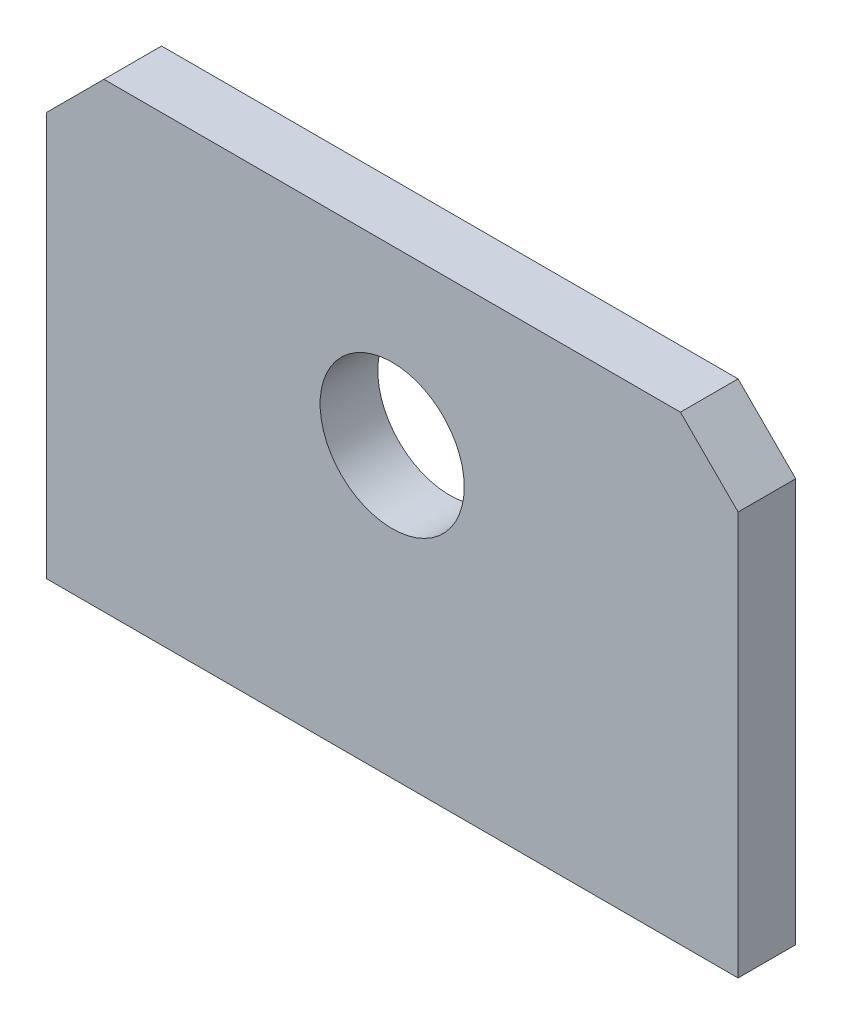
from build123d import *

# Parameters (mm, degrees)
SKETCH1_W          = 76.2
SKETCH1_H          = 50.8
EXTRUDE1_DEPTH     = 6.35
SKETCH2_R          = 7.9375
CUT_EXTRUDE1_DEPTH = 92.800885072
CHAMFER1_SIZE      = 6.35
CHAMFER2_SIZE      = 6.35


with BuildPart() as part:
    # Sketch1 → Extrude1 (new body)
    with BuildSketch(Plane.XY):
        with Locations((38.1, -25.4)):
            Rectangle(SKETCH1_W, SKETCH1_H)
    extrude(amount=EXTRUDE1_DEPTH)

    # Sketch2 → Cut-Extrude1 (cut, through all)
    with BuildSketch(Plane.XY.offset(6.35)):
        with Locations((38.1, -19.05)):
            Circle(SKETCH2_R)
    extrude(amount=-CUT_EXTRUDE1_DEPTH, mode=Mode.SUBTRACT)

    # Chamfer1
    chamfer1_edges = [part.edges().sort_by_distance(p)[0] for p in [
        (0, 0, 3.175),
    ]]
    chamfer(chamfer1_edges, length=CHAMFER1_SIZE)

    # Chamfer2
    chamfer2_edges = [part.edges().sort_by_distance(p)[0] for p in [
        (76.2, 0, 3.175),
    ]]
    chamfer(chamfer2_edges, length=CHAMFER2_SIZE)


solid = part.part
